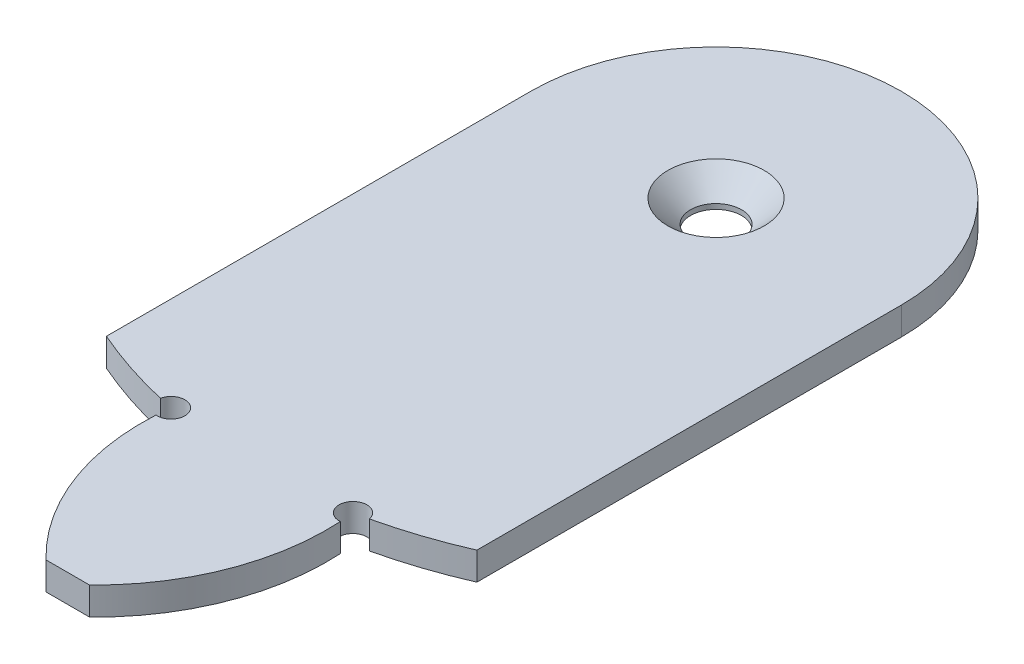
from build123d import *

# Parameters (mm, degrees)
EXTRUDE1_DEPTH = 3


with BuildPart() as part:
    # Sketch1 → Extrude1 (new body)
    with BuildSketch(Plane(origin=(0, 0, 0), x_dir=(1, 0, 0), z_dir=(0, 1, 0))):
        with BuildLine():
            Line((-20, 68.417356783), (-20, 22.591599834))
            ThreePointArc((-20, 22.591599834), (-15.71059546, 20.949713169), (-11.288626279, 19.708354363))
            ThreePointArc((-11.288626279, 19.708354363), (-8.614304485, 20.280700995), (-9.956137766, 17.897622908))
            ThreePointArc((-9.956137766, 17.897622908), (-8.287524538, 7.32388655), (-2.349351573, -1.582643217))
            Line((-2.349351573, -1.582643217), (2.349351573, -1.582643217))
            ThreePointArc((2.349351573, -1.582643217), (8.287524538, 7.32388655), (9.956137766, 17.897622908))
            ThreePointArc((9.956137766, 17.897622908), (8.614304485, 20.280700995), (11.288626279, 19.708354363))
            ThreePointArc((11.288626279, 19.708354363), (15.71059546, 20.949713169), (20, 22.591599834))
            Line((20, 22.591599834), (20, 68.417356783))
            ThreePointArc((20, 68.417356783), (0, 88.417356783), (-20, 68.417356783))
        make_face()
    extrude(amount=EXTRUDE1_DEPTH)

    # Sketch2 → CSK for M5 Countersunk Flat Head Screw1 (revolve, cut)
    with BuildSketch(Plane(origin=(0, 3, -68.417356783), x_dir=(0, 0, 1), z_dir=(1, 0, 0))):
        Polygon((0, 0), (0, 3), (2.75, 3), (2.75, 2.45), (5.2, 0), align=None)
    revolve(axis=Axis((0, 9.35, -68.417356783), (0, -1, 0)), mode=Mode.SUBTRACT)


solid = part.part
